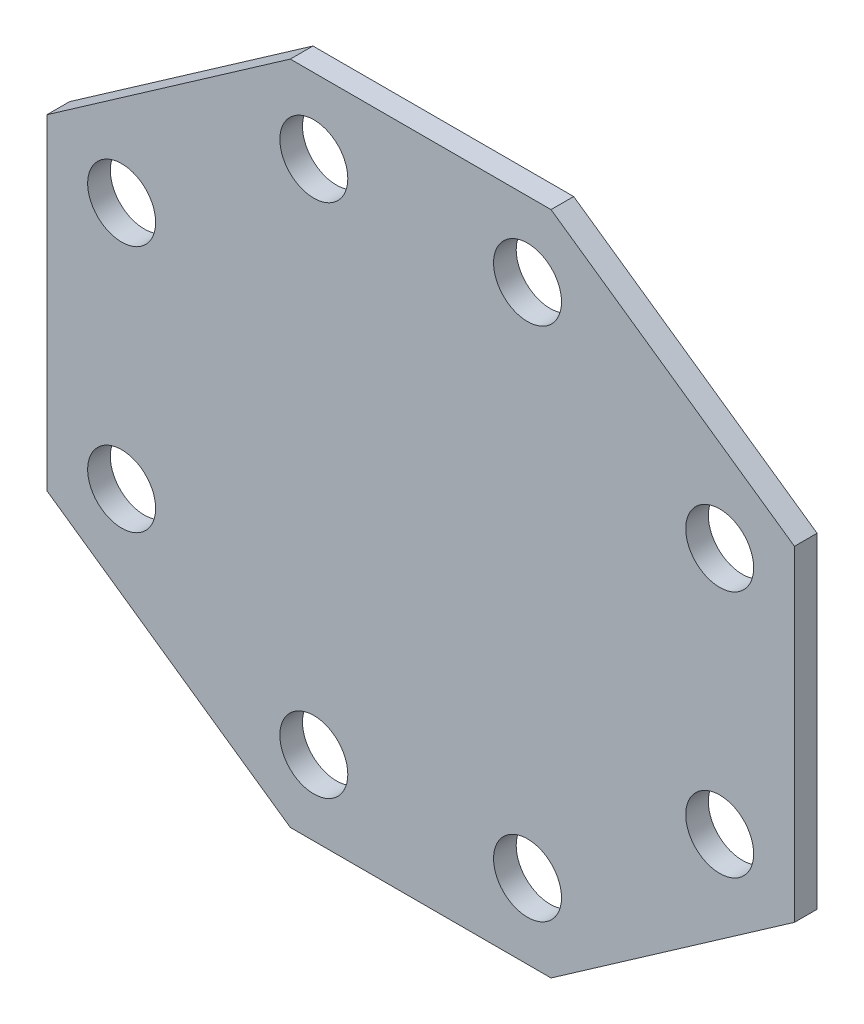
from build123d import *

# Parameters (mm, degrees)
MAIN_PLATE_DEPTH        = 31.75
CUT_EXTRUDE1_DEPTH      = 703.061769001
CUT_EXTRUDE1_DEPTH_BACK = 703.061769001
SKETCH5_R               = 47.625


with BuildPart() as part:
    # Sketch3 → Main Plate (new body)
    with BuildSketch(Plane(origin=(0, 0, 0), x_dir=(0, 1, 0), z_dir=(0, 0, 1))):
        Polygon((228.234235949, 523.855268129), (466.324268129, 182.70492307), (466.324268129, -182.70492307), (228.234235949, -523.855268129), (-228.234235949, -523.855268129), (-466.324268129, -182.70492307), (-466.324268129, 182.70492307), (-228.234235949, 523.855268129), align=None)
    extrude(amount=MAIN_PLATE_DEPTH)

    # Sketch5 → Cut-Extrude1 (cut, two sides: drawn at the far end of the back side and taken through both)
    with BuildSketch(Plane(origin=(0, 0, 0), x_dir=(0, 1, 0), z_dir=(0, 0, 1)).offset(-CUT_EXTRUDE1_DEPTH_BACK)):
        with Locations(Location((-173.588730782, 419.080268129, 0), (0, 0, 270))):
            Circle(SKETCH5_R)
        with Locations(Location((173.588730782, 419.080268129, 0), (0, 0, 270))):
            Circle(SKETCH5_R)
        with Locations(Location((361.549268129, 149.758610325, 0), (0, 0, 270))):
            Circle(SKETCH5_R)
        with Locations(Location((361.549268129, -149.758610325, 0), (0, 0, 270))):
            Circle(SKETCH5_R)
        with Locations(Location((173.588730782, -419.080268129, 0), (0, 0, 270))):
            Circle(SKETCH5_R)
        with Locations(Location((-173.588730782, -419.080268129, 0), (0, 0, 270))):
            Circle(SKETCH5_R)
        with Locations(Location((-361.549268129, -149.758610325, 0), (0, 0, 270))):
            Circle(SKETCH5_R)
        with Locations(Location((-361.549268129, 149.758610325, 0), (0, 0, 270))):
            Circle(SKETCH5_R)
    extrude(amount=CUT_EXTRUDE1_DEPTH + CUT_EXTRUDE1_DEPTH_BACK, mode=Mode.SUBTRACT)


solid = part.part
